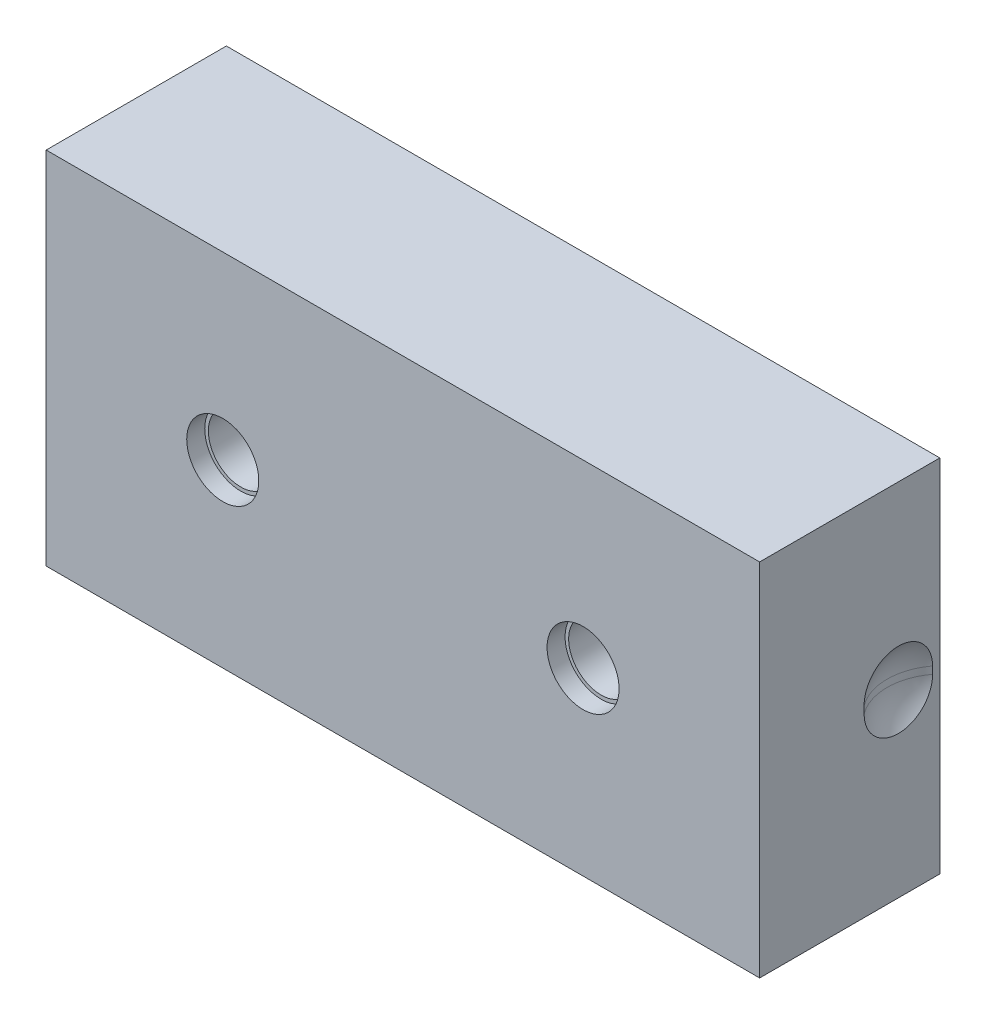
ISO-10303-21;
HEADER;
FILE_DESCRIPTION(('STEP AP214'),'2;1');
FILE_NAME('part.step','',(''),(''),'','','');
FILE_SCHEMA(('AUTOMOTIVE_DESIGN { 1 0 10303 214 1 1 1 1 }'));
ENDSEC;
DATA;
#1=APPLICATION_CONTEXT('core data for automotive mechanical design processes');
#2=APPLICATION_PROTOCOL_DEFINITION('international standard','automotive_design',2000,#1);
#3=PRODUCT_CONTEXT('',#1,'mechanical');
#4=PRODUCT('Part','Part','',(#3));
#5=PRODUCT_RELATED_PRODUCT_CATEGORY('part','',(#4));
#6=PRODUCT_DEFINITION_FORMATION('','',#4);
#7=PRODUCT_DEFINITION_CONTEXT('part definition',#1,'design');
#8=PRODUCT_DEFINITION('design','',#6,#7);
#9=PRODUCT_DEFINITION_SHAPE('','',#8);
#10=(LENGTH_UNIT() NAMED_UNIT(*) SI_UNIT(.MILLI.,.METRE.));
#11=(NAMED_UNIT(*) PLANE_ANGLE_UNIT() SI_UNIT($,.RADIAN.));
#12=(NAMED_UNIT(*) SI_UNIT($,.STERADIAN.) SOLID_ANGLE_UNIT());
#13=UNCERTAINTY_MEASURE_WITH_UNIT(LENGTH_MEASURE(1.E-05),#10,'distance_accuracy_value','');
#14=(GEOMETRIC_REPRESENTATION_CONTEXT(3) GLOBAL_UNCERTAINTY_ASSIGNED_CONTEXT((#13)) GLOBAL_UNIT_ASSIGNED_CONTEXT((#10,
#11,#12)) REPRESENTATION_CONTEXT('',''));
#15=CARTESIAN_POINT('',(0.,0.,0.));
#16=DIRECTION('',(0.,0.,1.));
#17=DIRECTION('',(1.,0.,0.));
#18=AXIS2_PLACEMENT_3D('',#15,#16,#17);
#19=CARTESIAN_POINT('',(-74.5004119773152,-24.0004119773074,99.5));
#20=DIRECTION('',(0.,0.,1.));
#21=DIRECTION('',(1.,0.,0.));
#22=AXIS2_PLACEMENT_3D('',#19,#20,#21);
#23=CYLINDRICAL_SURFACE('',#22,9.);
#24=CARTESIAN_POINT('',(-74.5004119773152,-24.0004119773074,79.5));
#25=DIRECTION('',(0.,0.,1.));
#26=DIRECTION('',(1.,0.,0.));
#27=AXIS2_PLACEMENT_3D('',#24,#25,#26);
#28=CIRCLE('',#27,9.);
#29=CARTESIAN_POINT('',(-65.5004119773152,-24.0004119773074,79.5));
#30=VERTEX_POINT('',#29);
#31=EDGE_CURVE('E284',#30,#30,#28,.F.);
#32=ORIENTED_EDGE('',*,*,#31,.T.);
#33=EDGE_LOOP('',(#32));
#34=FACE_BOUND('',#33,.T.);
#35=CARTESIAN_POINT('',(-74.5004119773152,-24.0004119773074,114.5));
#36=DIRECTION('',(0.,0.,1.));
#37=DIRECTION('',(1.,0.,0.));
#38=AXIS2_PLACEMENT_3D('',#35,#36,#37);
#39=CIRCLE('',#38,9.);
#40=CARTESIAN_POINT('',(-65.5004119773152,-24.0004119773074,114.5));
#41=VERTEX_POINT('',#40);
#42=EDGE_CURVE('E282',#41,#41,#39,.T.);
#43=ORIENTED_EDGE('',*,*,#42,.T.);
#44=EDGE_LOOP('',(#43));
#45=FACE_BOUND('',#44,.T.);
#46=ADVANCED_FACE('F14',(#34,#45),#23,.F.);
#47=CARTESIAN_POINT('',(-174.500411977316,-24.0004119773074,99.5));
#48=DIRECTION('',(0.,0.,1.));
#49=DIRECTION('',(1.,0.,0.));
#50=AXIS2_PLACEMENT_3D('',#47,#48,#49);
#51=CYLINDRICAL_SURFACE('',#50,9.);
#52=CARTESIAN_POINT('',(-174.500411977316,-24.0004119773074,79.5));
#53=DIRECTION('',(0.,0.,1.));
#54=DIRECTION('',(1.,0.,0.));
#55=AXIS2_PLACEMENT_3D('',#52,#53,#54);
#56=CIRCLE('',#55,9.);
#57=CARTESIAN_POINT('',(-165.500411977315,-24.0004119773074,79.5));
#58=VERTEX_POINT('',#57);
#59=EDGE_CURVE('E18',#58,#58,#56,.F.);
#60=ORIENTED_EDGE('',*,*,#59,.T.);
#61=EDGE_LOOP('',(#60));
#62=FACE_BOUND('',#61,.T.);
#63=CARTESIAN_POINT('',(-174.500411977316,-24.0004119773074,114.5));
#64=DIRECTION('',(0.,0.,1.));
#65=DIRECTION('',(1.,0.,0.));
#66=AXIS2_PLACEMENT_3D('',#63,#64,#65);
#67=CIRCLE('',#66,9.);
#68=CARTESIAN_POINT('',(-165.500411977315,-24.0004119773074,114.5));
#69=VERTEX_POINT('',#68);
#70=EDGE_CURVE('E279',#69,#69,#67,.T.);
#71=ORIENTED_EDGE('',*,*,#70,.T.);
#72=EDGE_LOOP('',(#71));
#73=FACE_BOUND('',#72,.T.);
#74=ADVANCED_FACE('F291',(#62,#73),#51,.F.);
#75=CARTESIAN_POINT('',(-174.500411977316,-24.0004119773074,79.5));
#76=DIRECTION('',(0.,0.,-1.));
#77=DIRECTION('',(-1.,0.,0.));
#78=AXIS2_PLACEMENT_3D('',#75,#76,#77);
#79=PLANE('',#78);
#80=ORIENTED_EDGE('',*,*,#59,.F.);
#81=EDGE_LOOP('',(#80));
#82=FACE_BOUND('',#81,.T.);
#83=CARTESIAN_POINT('',(-174.500411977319,-24.0004119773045,79.4999999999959));
#84=DIRECTION('',(0.,0.,1.));
#85=DIRECTION('',(1.,0.,0.));
#86=AXIS2_PLACEMENT_3D('',#83,#84,#85);
#87=CIRCLE('',#86,6.00000000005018);
#88=CARTESIAN_POINT('',(-168.500411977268,-24.0004119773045,79.4999999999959));
#89=VERTEX_POINT('',#88);
#90=EDGE_CURVE('E276',#89,#89,#87,.F.);
#91=ORIENTED_EDGE('',*,*,#90,.T.);
#92=EDGE_LOOP('',(#91));
#93=FACE_BOUND('',#92,.T.);
#94=ADVANCED_FACE('F294',(#82,#93),#79,.F.);
#95=CARTESIAN_POINT('',(-74.5004119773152,-24.0004119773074,79.5));
#96=DIRECTION('',(0.,0.,-1.));
#97=DIRECTION('',(-1.,0.,0.));
#98=AXIS2_PLACEMENT_3D('',#95,#96,#97);
#99=PLANE('',#98);
#100=ORIENTED_EDGE('',*,*,#31,.F.);
#101=EDGE_LOOP('',(#100));
#102=FACE_BOUND('',#101,.T.);
#103=CARTESIAN_POINT('',(-74.5004119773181,-24.0004119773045,79.5000000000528));
#104=DIRECTION('',(0.,0.,1.));
#105=DIRECTION('',(1.,0.,0.));
#106=AXIS2_PLACEMENT_3D('',#103,#104,#105);
#107=CIRCLE('',#106,6.0000000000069);
#108=CARTESIAN_POINT('',(-68.5004119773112,-24.0004119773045,79.5000000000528));
#109=VERTEX_POINT('',#108);
#110=EDGE_CURVE('E273',#109,#109,#107,.F.);
#111=ORIENTED_EDGE('',*,*,#110,.T.);
#112=EDGE_LOOP('',(#111));
#113=FACE_BOUND('',#112,.T.);
#114=ADVANCED_FACE('F297',(#102,#113),#99,.F.);
#115=CARTESIAN_POINT('',(-74.5004119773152,-24.0004119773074,114.5));
#116=DIRECTION('',(0.,0.,-1.));
#117=DIRECTION('',(-1.,0.,0.));
#118=AXIS2_PLACEMENT_3D('',#115,#116,#117);
#119=PLANE('',#118);
#120=CARTESIAN_POINT('',(-74.5004119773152,-24.0004119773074,114.5));
#121=DIRECTION('',(0.,0.,-1.));
#122=DIRECTION('',(-1.,0.,0.));
#123=AXIS2_PLACEMENT_3D('',#120,#121,#122);
#124=CIRCLE('',#123,10.);
#125=CARTESIAN_POINT('',(-84.5004119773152,-24.0004119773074,114.5));
#126=VERTEX_POINT('',#125);
#127=EDGE_CURVE('E270',#126,#126,#124,.F.);
#128=ORIENTED_EDGE('',*,*,#127,.T.);
#129=EDGE_LOOP('',(#128));
#130=FACE_BOUND('',#129,.T.);
#131=ORIENTED_EDGE('',*,*,#42,.F.);
#132=EDGE_LOOP('',(#131));
#133=FACE_BOUND('',#132,.T.);
#134=ADVANCED_FACE('F334',(#130,#133),#119,.F.);
#135=CARTESIAN_POINT('',(-174.500411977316,-24.0004119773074,114.5));
#136=DIRECTION('',(0.,0.,-1.));
#137=DIRECTION('',(-1.,0.,0.));
#138=AXIS2_PLACEMENT_3D('',#135,#136,#137);
#139=PLANE('',#138);
#140=CARTESIAN_POINT('',(-174.500411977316,-24.0004119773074,114.5));
#141=DIRECTION('',(0.,0.,-1.));
#142=DIRECTION('',(-1.,0.,0.));
#143=AXIS2_PLACEMENT_3D('',#140,#141,#142);
#144=CIRCLE('',#143,10.);
#145=CARTESIAN_POINT('',(-184.500411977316,-24.0004119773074,114.5));
#146=VERTEX_POINT('',#145);
#147=EDGE_CURVE('E220',#146,#146,#144,.F.);
#148=ORIENTED_EDGE('',*,*,#147,.T.);
#149=EDGE_LOOP('',(#148));
#150=FACE_BOUND('',#149,.T.);
#151=ORIENTED_EDGE('',*,*,#70,.F.);
#152=EDGE_LOOP('',(#151));
#153=FACE_BOUND('',#152,.T.);
#154=ADVANCED_FACE('F305',(#150,#153),#139,.F.);
#155=CARTESIAN_POINT('',(-174.500411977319,-24.0004119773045,79.4999999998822));
#156=DIRECTION('',(0.,0.,1.));
#157=DIRECTION('',(1.,0.,0.));
#158=AXIS2_PLACEMENT_3D('',#155,#156,#157);
#159=CONICAL_SURFACE('',#158,5.99999999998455,0.523598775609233);
#160=ORIENTED_EDGE('',*,*,#90,.F.);
#161=EDGE_LOOP('',(#160));
#162=FACE_BOUND('',#161,.T.);
#163=CARTESIAN_POINT('',(-174.500411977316,-24.0004119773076,78.2009618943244));
#164=DIRECTION('',(1.81804897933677E-13,-1.75169682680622E-13,-1.));
#165=DIRECTION('',(-1.,0.,-1.81804897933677E-13));
#166=AXIS2_PLACEMENT_3D('',#163,#164,#165);
#167=CIRCLE('',#166,5.25);
#168=CARTESIAN_POINT('',(-179.750411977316,-24.0004119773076,78.2009618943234));
#169=VERTEX_POINT('',#168);
#170=EDGE_CURVE('E218',#169,#169,#167,.T.);
#171=ORIENTED_EDGE('',*,*,#170,.T.);
#172=EDGE_LOOP('',(#171));
#173=FACE_BOUND('',#172,.T.);
#174=ADVANCED_FACE('F301',(#162,#173),#159,.F.);
#175=CARTESIAN_POINT('',(-74.5004119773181,-24.0004119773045,79.5000000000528));
#176=DIRECTION('',(0.,0.,1.));
#177=DIRECTION('',(1.,0.,0.));
#178=AXIS2_PLACEMENT_3D('',#175,#176,#177);
#179=CONICAL_SURFACE('',#178,6.0000000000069,0.523598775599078);
#180=ORIENTED_EDGE('',*,*,#110,.F.);
#181=EDGE_LOOP('',(#180));
#182=FACE_BOUND('',#181,.T.);
#183=CARTESIAN_POINT('',(-74.5004119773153,-24.0004119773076,78.2009618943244));
#184=DIRECTION('',(1.81804897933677E-13,-1.75169682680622E-13,-1.));
#185=DIRECTION('',(-1.,0.,-1.81804897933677E-13));
#186=AXIS2_PLACEMENT_3D('',#183,#184,#185);
#187=CIRCLE('',#186,5.25);
#188=CARTESIAN_POINT('',(-79.7504119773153,-24.0004119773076,78.2009618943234));
#189=VERTEX_POINT('',#188);
#190=EDGE_CURVE('E80',#189,#189,#187,.T.);
#191=ORIENTED_EDGE('',*,*,#190,.T.);
#192=EDGE_LOOP('',(#191));
#193=FACE_BOUND('',#192,.T.);
#194=ADVANCED_FACE('F304',(#182,#193),#179,.F.);
#195=CARTESIAN_POINT('',(-74.5004119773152,-24.0004119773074,117.));
#196=DIRECTION('',(0.,0.,-1.));
#197=DIRECTION('',(-1.,0.,0.));
#198=AXIS2_PLACEMENT_3D('',#195,#196,#197);
#199=CYLINDRICAL_SURFACE('',#198,10.);
#200=CARTESIAN_POINT('',(-74.5004119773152,-24.0004119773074,119.5));
#201=DIRECTION('',(0.,0.,-1.));
#202=DIRECTION('',(-1.,0.,0.));
#203=AXIS2_PLACEMENT_3D('',#200,#201,#202);
#204=CIRCLE('',#203,10.);
#205=CARTESIAN_POINT('',(-84.5004119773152,-24.0004119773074,119.5));
#206=VERTEX_POINT('',#205);
#207=EDGE_CURVE('E515',#206,#206,#204,.F.);
#208=ORIENTED_EDGE('',*,*,#207,.T.);
#209=EDGE_LOOP('',(#208));
#210=FACE_BOUND('',#209,.T.);
#211=ORIENTED_EDGE('',*,*,#127,.F.);
#212=EDGE_LOOP('',(#211));
#213=FACE_BOUND('',#212,.T.);
#214=ADVANCED_FACE('F321',(#210,#213),#199,.F.);
#215=CARTESIAN_POINT('',(-174.500411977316,-24.0004119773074,117.));
#216=DIRECTION('',(0.,0.,-1.));
#217=DIRECTION('',(-1.,0.,0.));
#218=AXIS2_PLACEMENT_3D('',#215,#216,#217);
#219=CYLINDRICAL_SURFACE('',#218,10.);
#220=CARTESIAN_POINT('',(-174.500411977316,-24.0004119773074,119.5));
#221=DIRECTION('',(0.,0.,-1.));
#222=DIRECTION('',(-1.,0.,0.));
#223=AXIS2_PLACEMENT_3D('',#220,#221,#222);
#224=CIRCLE('',#223,10.);
#225=CARTESIAN_POINT('',(-184.500411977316,-24.0004119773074,119.5));
#226=VERTEX_POINT('',#225);
#227=EDGE_CURVE('E512',#226,#226,#224,.F.);
#228=ORIENTED_EDGE('',*,*,#227,.T.);
#229=EDGE_LOOP('',(#228));
#230=FACE_BOUND('',#229,.T.);
#231=ORIENTED_EDGE('',*,*,#147,.F.);
#232=EDGE_LOOP('',(#231));
#233=FACE_BOUND('',#232,.T.);
#234=ADVANCED_FACE('F312',(#230,#233),#219,.F.);
#235=CARTESIAN_POINT('',(-174.500411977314,-24.0004119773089,71.));
#236=DIRECTION('',(1.81804897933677E-13,-1.75169682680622E-13,-1.));
#237=DIRECTION('',(-1.,0.,-1.81804897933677E-13));
#238=AXIS2_PLACEMENT_3D('',#235,#236,#237);
#239=CYLINDRICAL_SURFACE('',#238,5.25);
#240=CARTESIAN_POINT('',(-174.500411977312,-24.0004119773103,62.4999999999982));
#241=DIRECTION('',(1.81804897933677E-13,-1.75169682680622E-13,-1.));
#242=DIRECTION('',(-1.,0.,-1.81804897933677E-13));
#243=AXIS2_PLACEMENT_3D('',#240,#241,#242);
#244=CIRCLE('',#243,5.25);
#245=CARTESIAN_POINT('',(-179.750411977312,-24.0004119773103,62.4999999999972));
#246=VERTEX_POINT('',#245);
#247=EDGE_CURVE('E517',#246,#246,#244,.F.);
#248=ORIENTED_EDGE('',*,*,#247,.F.);
#249=EDGE_LOOP('',(#248));
#250=FACE_BOUND('',#249,.T.);
#251=ORIENTED_EDGE('',*,*,#170,.F.);
#252=EDGE_LOOP('',(#251));
#253=FACE_BOUND('',#252,.T.);
#254=ADVANCED_FACE('F309',(#250,#253),#239,.F.);
#255=CARTESIAN_POINT('',(-74.500411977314,-24.0004119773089,71.));
#256=DIRECTION('',(1.81804897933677E-13,-1.75169682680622E-13,-1.));
#257=DIRECTION('',(-1.,0.,-1.81804897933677E-13));
#258=AXIS2_PLACEMENT_3D('',#255,#256,#257);
#259=CYLINDRICAL_SURFACE('',#258,5.25);
#260=CARTESIAN_POINT('',(-74.5004119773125,-24.0004119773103,62.4999999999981));
#261=DIRECTION('',(1.81804897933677E-13,-1.75169682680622E-13,-1.));
#262=DIRECTION('',(-1.,0.,-1.81804897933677E-13));
#263=AXIS2_PLACEMENT_3D('',#260,#261,#262);
#264=CIRCLE('',#263,5.25);
#265=CARTESIAN_POINT('',(-79.7504119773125,-24.0004119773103,62.4999999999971));
#266=VERTEX_POINT('',#265);
#267=EDGE_CURVE('E89',#266,#266,#264,.F.);
#268=ORIENTED_EDGE('',*,*,#267,.F.);
#269=EDGE_LOOP('',(#268));
#270=FACE_BOUND('',#269,.T.);
#271=ORIENTED_EDGE('',*,*,#190,.F.);
#272=EDGE_LOOP('',(#271));
#273=FACE_BOUND('',#272,.T.);
#274=ADVANCED_FACE('F311',(#270,#273),#259,.F.);
#275=CARTESIAN_POINT('',(-236.250411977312,-25.0005435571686,81.));
#276=DIRECTION('',(0.490058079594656,0.735052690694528,0.46855161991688));
#277=DIRECTION('',(-0.865395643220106,0.34577965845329,0.362666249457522));
#278=AXIS2_PLACEMENT_3D('',#275,#276,#277);
#279=SPHERICAL_SURFACE('',#278,15.9);
#280=CARTESIAN_POINT('',(-236.250411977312,-25.0005435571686,81.));
#281=DIRECTION('',(0.,-1.,0.));
#282=DIRECTION('',(0.,0.,-1.));
#283=AXIS2_PLACEMENT_3D('',#280,#281,#282);
#284=CIRCLE('',#283,15.9);
#285=CARTESIAN_POINT('',(-223.500411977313,-25.0005435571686,90.4998684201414));
#286=VERTEX_POINT('',#285);
#287=CARTESIAN_POINT('',(-223.500411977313,-25.0005435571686,71.5001315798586));
#288=VERTEX_POINT('',#287);
#289=EDGE_CURVE('E74',#286,#288,#284,.F.);
#290=ORIENTED_EDGE('',*,*,#289,.T.);
#291=CARTESIAN_POINT('',(-223.500411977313,-25.0005435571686,71.5001315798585));
#292=CARTESIAN_POINT('',(-223.500411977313,-25.26773035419,71.5001028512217));
#293=CARTESIAN_POINT('',(-223.500411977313,-25.5349130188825,71.5114024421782));
#294=CARTESIAN_POINT('',(-223.500411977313,-26.0673668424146,71.556450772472));
#295=CARTESIAN_POINT('',(-223.500411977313,-26.3326380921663,71.5901984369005));
#296=CARTESIAN_POINT('',(-223.500411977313,-26.8592066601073,71.6799039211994));
#297=CARTESIAN_POINT('',(-223.500411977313,-27.1205066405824,71.7358461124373));
#298=CARTESIAN_POINT('',(-223.500411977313,-27.6374645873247,71.8695336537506));
#299=CARTESIAN_POINT('',(-223.500411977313,-27.8931226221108,71.9472787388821));
#300=CARTESIAN_POINT('',(-223.500411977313,-28.3970996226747,72.1240632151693));
#301=CARTESIAN_POINT('',(-223.500411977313,-28.6454151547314,72.2231123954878));
#302=CARTESIAN_POINT('',(-223.500411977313,-29.1328237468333,72.4417813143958));
#303=CARTESIAN_POINT('',(-223.500411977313,-29.3719166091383,72.5614014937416));
#304=CARTESIAN_POINT('',(-223.500411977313,-29.8391260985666,72.8203339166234));
#305=CARTESIAN_POINT('',(-223.500411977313,-30.067244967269,72.9596421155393));
#306=CARTESIAN_POINT('',(-223.500411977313,-30.5109364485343,73.2569781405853));
#307=CARTESIAN_POINT('',(-223.500411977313,-30.7265091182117,73.415005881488));
#308=CARTESIAN_POINT('',(-223.500411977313,-31.143584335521,73.7486640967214));
#309=CARTESIAN_POINT('',(-223.500411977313,-31.345086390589,73.9242951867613));
#310=CARTESIAN_POINT('',(-223.500411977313,-31.7325755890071,74.2919030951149));
#311=CARTESIAN_POINT('',(-223.500411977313,-31.9185630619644,74.4838795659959));
#312=CARTESIAN_POINT('',(-223.500411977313,-32.2737349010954,74.8828494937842));
#313=CARTESIAN_POINT('',(-223.500411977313,-32.4429165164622,75.0898453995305));
#314=CARTESIAN_POINT('',(-223.500411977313,-32.7632390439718,75.5173545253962));
#315=CARTESIAN_POINT('',(-223.500411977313,-32.9143799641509,75.7378677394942));
#316=CARTESIAN_POINT('',(-223.500411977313,-33.1975402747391,76.1908336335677));
#317=CARTESIAN_POINT('',(-223.500411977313,-33.3295605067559,76.4232857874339));
#318=CARTESIAN_POINT('',(-223.500411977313,-33.5735487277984,76.8984858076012));
#319=CARTESIAN_POINT('',(-223.500411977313,-33.6855167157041,77.1412336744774));
#320=CARTESIAN_POINT('',(-223.500411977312,-33.8885978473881,77.6352833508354));
#321=CARTESIAN_POINT('',(-223.500411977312,-33.979712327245,77.8865846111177));
#322=CARTESIAN_POINT('',(-223.500411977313,-34.1404478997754,78.395969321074));
#323=CARTESIAN_POINT('',(-223.500411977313,-34.2100689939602,78.6540527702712));
#324=CARTESIAN_POINT('',(-223.500411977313,-34.3273240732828,79.1751725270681));
#325=CARTESIAN_POINT('',(-223.500411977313,-34.3749576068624,79.4382089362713));
#326=CARTESIAN_POINT('',(-223.500411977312,-34.447896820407,79.9673594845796));
#327=CARTESIAN_POINT('',(-223.500411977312,-34.4732024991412,80.2334736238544));
#328=CARTESIAN_POINT('',(-223.500411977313,-34.5013064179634,80.7668938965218));
#329=CARTESIAN_POINT('',(-223.500411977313,-34.5041041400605,81.0342000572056));
#330=CARTESIAN_POINT('',(-223.500411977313,-34.4871708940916,81.568097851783));
#331=CARTESIAN_POINT('',(-223.500411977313,-34.4674399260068,81.8346894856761));
#332=CARTESIAN_POINT('',(-223.500411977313,-34.4055898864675,82.3652602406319));
#333=CARTESIAN_POINT('',(-223.500411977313,-34.3634710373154,82.629239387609));
#334=CARTESIAN_POINT('',(-223.500411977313,-34.2571448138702,83.1527111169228));
#335=CARTESIAN_POINT('',(-223.500411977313,-34.1929374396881,83.4122036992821));
#336=CARTESIAN_POINT('',(-223.500411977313,-34.0428908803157,83.9248566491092));
#337=CARTESIAN_POINT('',(-223.500411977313,-33.957051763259,84.1780170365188));
#338=CARTESIAN_POINT('',(-223.500411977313,-33.7643518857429,84.676206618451));
#339=CARTESIAN_POINT('',(-223.500411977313,-33.6574911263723,84.9212358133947));
#340=CARTESIAN_POINT('',(-223.500411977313,-33.4235058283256,85.4014248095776));
#341=CARTESIAN_POINT('',(-223.500411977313,-33.2963809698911,85.6365844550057));
#342=CARTESIAN_POINT('',(-223.500411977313,-33.0227696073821,86.0953631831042));
#343=CARTESIAN_POINT('',(-223.500411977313,-32.8762826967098,86.3189820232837));
#344=CARTESIAN_POINT('',(-223.500411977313,-32.5649999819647,86.753071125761));
#345=CARTESIAN_POINT('',(-223.500411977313,-32.4002052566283,86.9635421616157));
#346=CARTESIAN_POINT('',(-223.500411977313,-32.053471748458,87.3698533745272));
#347=CARTESIAN_POINT('',(-223.500411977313,-31.871532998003,87.565693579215));
#348=CARTESIAN_POINT('',(-223.500411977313,-31.4918300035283,87.9413261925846));
#349=CARTESIAN_POINT('',(-223.500411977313,-31.2940678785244,88.1211207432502));
#350=CARTESIAN_POINT('',(-223.500411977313,-30.8841024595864,88.46341367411));
#351=CARTESIAN_POINT('',(-223.500411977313,-30.6718991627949,88.625912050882));
#352=CARTESIAN_POINT('',(-223.500411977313,-30.2344865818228,88.932508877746));
#353=CARTESIAN_POINT('',(-223.500411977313,-30.0092729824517,89.0766011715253));
#354=CARTESIAN_POINT('',(-223.500411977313,-29.5475128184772,89.3452934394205));
#355=CARTESIAN_POINT('',(-223.500411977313,-29.3109665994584,89.4698940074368));
#356=CARTESIAN_POINT('',(-223.500411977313,-28.828063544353,89.6987950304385));
#357=CARTESIAN_POINT('',(-223.500411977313,-28.5817005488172,89.8030824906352));
#358=CARTESIAN_POINT('',(-223.500411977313,-28.0810642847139,89.9905132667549));
#359=CARTESIAN_POINT('',(-223.500411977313,-27.8267912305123,90.0736571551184));
#360=CARTESIAN_POINT('',(-223.500411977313,-27.3124764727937,90.2181196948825));
#361=CARTESIAN_POINT('',(-223.500411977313,-27.0524425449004,90.2794660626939));
#362=CARTESIAN_POINT('',(-223.500411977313,-26.5282358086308,90.3800228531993));
#363=CARTESIAN_POINT('',(-223.500411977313,-26.264065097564,90.4192441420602));
#364=CARTESIAN_POINT('',(-223.500411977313,-25.8328568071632,90.4648086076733));
#365=CARTESIAN_POINT('',(-223.500411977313,-25.666509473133,90.4779644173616));
#366=CARTESIAN_POINT('',(-223.500411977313,-25.3336283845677,90.4954880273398));
#367=CARTESIAN_POINT('',(-223.500411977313,-25.1670953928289,90.4998703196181));
#368=CARTESIAN_POINT('',(-223.500411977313,-25.0005435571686,90.4998684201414));
#369=B_SPLINE_CURVE_WITH_KNOTS('',3,(#291,#292,#293,#294,#295,#296,#297,#298,#299,#300,#301,
#302,#303,#304,#305,#306,#307,#308,#309,#310,#311,#312,#313,#314,#315,#316,#317,#318,#319,#320,
#321,#322,#323,#324,#325,#326,#327,#328,#329,#330,#331,#332,#333,#334,#335,#336,#337,#338,#339,
#340,#341,#342,#343,#344,#345,#346,#347,#348,#349,#350,#351,#352,#353,#354,#355,#356,#357,#358,
#359,#360,#361,#362,#363,#364,#365,#366,#367,#368),.UNSPECIFIED.,.F.,.F.,(4,2,2,2,2,2,2,2,2,2,2,
2,2,2,2,2,2,2,2,2,2,2,2,2,2,2,2,2,2,2,2,2,2,2,2,2,2,2,4),(0.,0.801315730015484,1.60259309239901,
2.40330722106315,3.20401162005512,4.00508472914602,4.80617500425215,5.60710094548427,
6.40802324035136,7.20897355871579,8.00990685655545,8.81097103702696,9.6120348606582,
10.4130634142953,11.214092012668,12.0150692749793,12.8160464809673,13.6170401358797,
14.4180338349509,15.219045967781,16.0200581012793,16.8210622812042,17.6220664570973,
18.4230681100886,19.2240697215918,20.0250839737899,20.8261150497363,21.6270989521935,
22.4280813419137,23.2289566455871,24.0298321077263,24.8309747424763,25.6320929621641,
26.4337220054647,27.2353293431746,28.0359137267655,28.8361045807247,29.3364921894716,
29.8360525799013),.UNSPECIFIED.);
#370=EDGE_CURVE('E72',#288,#286,#369,.T.);
#371=ORIENTED_EDGE('',*,*,#370,.T.);
#372=EDGE_LOOP('',(#290,#371));
#373=FACE_BOUND('',#372,.T.);
#374=ADVANCED_FACE('F76',(#373),#279,.F.);
#375=CARTESIAN_POINT('',(-236.250411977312,8.66438002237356,81.));
#376=DIRECTION('',(0.,-1.,0.));
#377=DIRECTION('',(0.,0.,-1.));
#378=AXIS2_PLACEMENT_3D('',#375,#376,#377);
#379=CYLINDRICAL_SURFACE('',#378,15.9);
#380=ORIENTED_EDGE('',*,*,#289,.F.);
#381=DIRECTION('',(0.,1.,0.));
#382=VECTOR('',#381,1.);
#383=CARTESIAN_POINT('',(-223.500411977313,-24.0004119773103,90.4998684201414));
#384=LINE('',#383,#382);
#385=CARTESIAN_POINT('',(-223.500411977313,-23.0002803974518,90.4998684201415));
#386=VERTEX_POINT('',#385);
#387=EDGE_CURVE('E92',#286,#386,#384,.T.);
#388=ORIENTED_EDGE('',*,*,#387,.T.);
#389=CARTESIAN_POINT('',(-236.250411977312,-23.0002803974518,81.));
#390=DIRECTION('',(0.,-1.,0.));
#391=DIRECTION('',(0.,0.,-1.));
#392=AXIS2_PLACEMENT_3D('',#389,#390,#391);
#393=CIRCLE('',#392,15.9);
#394=CARTESIAN_POINT('',(-223.500411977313,-23.0002803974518,71.5001315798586));
#395=VERTEX_POINT('',#394);
#396=EDGE_CURVE('E79',#386,#395,#393,.F.);
#397=ORIENTED_EDGE('',*,*,#396,.T.);
#398=DIRECTION('',(0.,1.,0.));
#399=VECTOR('',#398,1.);
#400=CARTESIAN_POINT('',(-223.500411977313,-24.0004119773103,71.5001315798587));
#401=LINE('',#400,#399);
#402=EDGE_CURVE('E83',#395,#288,#401,.F.);
#403=ORIENTED_EDGE('',*,*,#402,.T.);
#404=EDGE_LOOP('',(#380,#388,#397,#403));
#405=FACE_BOUND('',#404,.T.);
#406=ADVANCED_FACE('F84',(#405),#379,.F.);
#407=CARTESIAN_POINT('',(-236.250411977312,-23.0002803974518,81.));
#408=DIRECTION('',(0.490058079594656,0.735052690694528,0.46855161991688));
#409=DIRECTION('',(-0.865395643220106,0.34577965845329,0.362666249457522));
#410=AXIS2_PLACEMENT_3D('',#407,#408,#409);
#411=SPHERICAL_SURFACE('',#410,15.9);
#412=ORIENTED_EDGE('',*,*,#396,.F.);
#413=CARTESIAN_POINT('',(-223.500411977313,-23.0002803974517,90.4998684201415));
#414=CARTESIAN_POINT('',(-223.500411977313,-22.7330936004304,90.4998971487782));
#415=CARTESIAN_POINT('',(-223.500411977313,-22.465910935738,90.4885975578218));
#416=CARTESIAN_POINT('',(-223.500411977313,-21.9334571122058,90.4435492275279));
#417=CARTESIAN_POINT('',(-223.500411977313,-21.6681858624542,90.4098015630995));
#418=CARTESIAN_POINT('',(-223.500411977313,-21.1416172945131,90.3200960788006));
#419=CARTESIAN_POINT('',(-223.500411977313,-20.880317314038,90.2641538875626));
#420=CARTESIAN_POINT('',(-223.500411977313,-20.3633593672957,90.1304663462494));
#421=CARTESIAN_POINT('',(-223.500411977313,-20.1077013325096,90.052721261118));
#422=CARTESIAN_POINT('',(-223.500411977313,-19.6037243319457,89.8759367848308));
#423=CARTESIAN_POINT('',(-223.500411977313,-19.3554087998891,89.7768876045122));
#424=CARTESIAN_POINT('',(-223.500411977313,-18.8680002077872,89.5582186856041));
#425=CARTESIAN_POINT('',(-223.500411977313,-18.6289073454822,89.4385985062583));
#426=CARTESIAN_POINT('',(-223.500411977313,-18.1616978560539,89.1796660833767));
#427=CARTESIAN_POINT('',(-223.500411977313,-17.9335789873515,89.0403578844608));
#428=CARTESIAN_POINT('',(-223.500411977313,-17.4898875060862,88.7430218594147));
#429=CARTESIAN_POINT('',(-223.500411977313,-17.2743148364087,88.5849941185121));
#430=CARTESIAN_POINT('',(-223.500411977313,-16.8572396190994,88.2513359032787));
#431=CARTESIAN_POINT('',(-223.500411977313,-16.6557375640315,88.0757048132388));
#432=CARTESIAN_POINT('',(-223.500411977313,-16.2682483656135,87.7080969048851));
#433=CARTESIAN_POINT('',(-223.500411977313,-16.0822608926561,87.5161204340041));
#434=CARTESIAN_POINT('',(-223.500411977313,-15.7270890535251,87.1171505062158));
#435=CARTESIAN_POINT('',(-223.500411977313,-15.5579074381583,86.9101546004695));
#436=CARTESIAN_POINT('',(-223.500411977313,-15.2375849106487,86.4826454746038));
#437=CARTESIAN_POINT('',(-223.500411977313,-15.0864439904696,86.2621322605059));
#438=CARTESIAN_POINT('',(-223.500411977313,-14.8032836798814,85.8091663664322));
#439=CARTESIAN_POINT('',(-223.500411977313,-14.6712634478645,85.5767142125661));
#440=CARTESIAN_POINT('',(-223.500411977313,-14.427275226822,85.1015141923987));
#441=CARTESIAN_POINT('',(-223.500411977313,-14.3153072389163,84.8587663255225));
#442=CARTESIAN_POINT('',(-223.500411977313,-14.1122261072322,84.3647166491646));
#443=CARTESIAN_POINT('',(-223.500411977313,-14.0211116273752,84.1134153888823));
#444=CARTESIAN_POINT('',(-223.500411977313,-13.8603760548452,83.6040306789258));
#445=CARTESIAN_POINT('',(-223.500411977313,-13.7907549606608,83.3459472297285));
#446=CARTESIAN_POINT('',(-223.500411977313,-13.6734998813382,82.8248274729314));
#447=CARTESIAN_POINT('',(-223.500411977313,-13.6258663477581,82.5617910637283));
#448=CARTESIAN_POINT('',(-223.500411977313,-13.5529271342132,82.0326405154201));
#449=CARTESIAN_POINT('',(-223.500411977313,-13.5276214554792,81.7665263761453));
#450=CARTESIAN_POINT('',(-223.500411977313,-13.4995175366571,81.2331061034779));
#451=CARTESIAN_POINT('',(-223.500411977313,-13.4967198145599,80.9657999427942));
#452=CARTESIAN_POINT('',(-223.500411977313,-13.513653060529,80.4319021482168));
#453=CARTESIAN_POINT('',(-223.500411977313,-13.5333840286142,80.1653105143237));
#454=CARTESIAN_POINT('',(-223.500411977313,-13.5952340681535,79.6347397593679));
#455=CARTESIAN_POINT('',(-223.500411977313,-13.6373529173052,79.3707606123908));
#456=CARTESIAN_POINT('',(-223.500411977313,-13.7436791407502,78.8472888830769));
#457=CARTESIAN_POINT('',(-223.500411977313,-13.8078865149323,78.5877963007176));
#458=CARTESIAN_POINT('',(-223.500411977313,-13.9579330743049,78.0751433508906));
#459=CARTESIAN_POINT('',(-223.500411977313,-14.0437721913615,77.8219829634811));
#460=CARTESIAN_POINT('',(-223.500411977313,-14.2364720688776,77.323793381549));
#461=CARTESIAN_POINT('',(-223.500411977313,-14.3433328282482,77.0787641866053));
#462=CARTESIAN_POINT('',(-223.500411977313,-14.5773181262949,76.5985751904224));
#463=CARTESIAN_POINT('',(-223.500411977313,-14.7044429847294,76.3634155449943));
#464=CARTESIAN_POINT('',(-223.500411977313,-14.9780543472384,75.9046368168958));
#465=CARTESIAN_POINT('',(-223.500411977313,-15.1245412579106,75.6810179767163));
#466=CARTESIAN_POINT('',(-223.500411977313,-15.4358239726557,75.2469288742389));
#467=CARTESIAN_POINT('',(-223.500411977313,-15.6006186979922,75.0364578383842));
#468=CARTESIAN_POINT('',(-223.500411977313,-15.9473522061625,74.6301466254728));
#469=CARTESIAN_POINT('',(-223.500411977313,-16.1292909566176,74.434306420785));
#470=CARTESIAN_POINT('',(-223.500411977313,-16.5089939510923,74.0586738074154));
#471=CARTESIAN_POINT('',(-223.500411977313,-16.7067560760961,73.8788792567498));
#472=CARTESIAN_POINT('',(-223.500411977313,-17.1167214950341,73.5365863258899));
#473=CARTESIAN_POINT('',(-223.500411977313,-17.3289247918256,73.3740879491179));
#474=CARTESIAN_POINT('',(-223.500411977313,-17.7663373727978,73.0674911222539));
#475=CARTESIAN_POINT('',(-223.500411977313,-17.9915509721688,72.9233988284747));
#476=CARTESIAN_POINT('',(-223.500411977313,-18.4533111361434,72.6547065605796));
#477=CARTESIAN_POINT('',(-223.500411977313,-18.6898573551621,72.5301059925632));
#478=CARTESIAN_POINT('',(-223.500411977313,-19.1727604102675,72.3012049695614));
#479=CARTESIAN_POINT('',(-223.500411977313,-19.4191234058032,72.1969175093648));
#480=CARTESIAN_POINT('',(-223.500411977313,-19.9197596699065,72.009486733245));
#481=CARTESIAN_POINT('',(-223.500411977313,-20.1740327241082,71.9263428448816));
#482=CARTESIAN_POINT('',(-223.500411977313,-20.6883474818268,71.7818803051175));
#483=CARTESIAN_POINT('',(-223.500411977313,-20.9483814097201,71.7205339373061));
#484=CARTESIAN_POINT('',(-223.500411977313,-21.4725881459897,71.6199771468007));
#485=CARTESIAN_POINT('',(-223.500411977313,-21.7367588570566,71.5807558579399));
#486=CARTESIAN_POINT('',(-223.500411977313,-22.1679671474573,71.5351913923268));
#487=CARTESIAN_POINT('',(-223.500411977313,-22.3343144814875,71.5220355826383));
#488=CARTESIAN_POINT('',(-223.500411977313,-22.6671955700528,71.5045119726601));
#489=CARTESIAN_POINT('',(-223.500411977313,-22.8337285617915,71.5001296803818));
#490=CARTESIAN_POINT('',(-223.500411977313,-23.0002803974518,71.5001315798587));
#491=B_SPLINE_CURVE_WITH_KNOTS('',3,(#413,#414,#415,#416,#417,#418,#419,#420,#421,#422,#423,
#424,#425,#426,#427,#428,#429,#430,#431,#432,#433,#434,#435,#436,#437,#438,#439,#440,#441,#442,
#443,#444,#445,#446,#447,#448,#449,#450,#451,#452,#453,#454,#455,#456,#457,#458,#459,#460,#461,
#462,#463,#464,#465,#466,#467,#468,#469,#470,#471,#472,#473,#474,#475,#476,#477,#478,#479,#480,
#481,#482,#483,#484,#485,#486,#487,#488,#489,#490),.UNSPECIFIED.,.F.,.F.,(4,2,2,2,2,2,2,2,2,2,2,
2,2,2,2,2,2,2,2,2,2,2,2,2,2,2,2,2,2,2,2,2,2,2,2,2,2,2,4),(0.,0.801315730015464,1.602593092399,
2.40330722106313,3.20401162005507,4.00508472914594,4.80617500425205,5.60710094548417,
6.40802324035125,7.20897355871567,8.00990685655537,8.81097103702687,9.61203486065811,
10.4130634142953,11.214092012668,12.0150692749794,12.8160464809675,13.61704013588,
14.418033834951,15.2190459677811,16.0200581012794,16.8210622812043,17.6220664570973,
18.4230681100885,19.2240697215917,20.0250839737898,20.8261150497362,21.6270989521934,
22.4280813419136,23.2289566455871,24.0298321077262,24.8309747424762,25.632092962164,
26.4337220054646,27.2353293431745,28.0359137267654,28.8361045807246,29.3364921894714,
29.8360525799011),.UNSPECIFIED.);
#492=EDGE_CURVE('E94',#386,#395,#491,.T.);
#493=ORIENTED_EDGE('',*,*,#492,.T.);
#494=EDGE_LOOP('',(#412,#493));
#495=FACE_BOUND('',#494,.T.);
#496=ADVANCED_FACE('F156',(#495),#411,.F.);
#497=CARTESIAN_POINT('',(-12.7504119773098,-25.0005435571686,81.));
#498=DIRECTION('',(0.490058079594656,0.735052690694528,0.46855161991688));
#499=DIRECTION('',(-0.865395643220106,0.34577965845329,0.362666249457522));
#500=AXIS2_PLACEMENT_3D('',#497,#498,#499);
#501=SPHERICAL_SURFACE('',#500,15.9);
#502=CARTESIAN_POINT('',(-12.7504119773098,-25.0005435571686,81.));
#503=DIRECTION('',(0.,1.,0.));
#504=DIRECTION('',(0.,0.,1.));
#505=AXIS2_PLACEMENT_3D('',#502,#503,#504);
#506=CIRCLE('',#505,15.9);
#507=CARTESIAN_POINT('',(-25.5004119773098,-25.0005435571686,71.5001315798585));
#508=VERTEX_POINT('',#507);
#509=CARTESIAN_POINT('',(-25.5004119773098,-25.0005435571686,90.4998684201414));
#510=VERTEX_POINT('',#509);
#511=EDGE_CURVE('E263',#508,#510,#506,.T.);
#512=ORIENTED_EDGE('',*,*,#511,.T.);
#513=CARTESIAN_POINT('',(-25.5004119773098,-25.0005435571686,90.4998684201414));
#514=CARTESIAN_POINT('',(-25.5004119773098,-25.26773035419,90.4998971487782));
#515=CARTESIAN_POINT('',(-25.5004119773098,-25.5349130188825,90.4885975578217));
#516=CARTESIAN_POINT('',(-25.5004119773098,-26.0673668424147,90.4435492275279));
#517=CARTESIAN_POINT('',(-25.5004119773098,-26.3326380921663,90.4098015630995));
#518=CARTESIAN_POINT('',(-25.5004119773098,-26.8592066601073,90.3200960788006));
#519=CARTESIAN_POINT('',(-25.5004119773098,-27.1205066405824,90.2641538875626));
#520=CARTESIAN_POINT('',(-25.5004119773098,-27.6374645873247,90.1304663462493));
#521=CARTESIAN_POINT('',(-25.5004119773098,-27.8931226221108,90.0527212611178));
#522=CARTESIAN_POINT('',(-25.5004119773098,-28.3970996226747,89.8759367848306));
#523=CARTESIAN_POINT('',(-25.5004119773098,-28.6454151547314,89.7768876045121));
#524=CARTESIAN_POINT('',(-25.5004119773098,-29.1328237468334,89.5582186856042));
#525=CARTESIAN_POINT('',(-25.5004119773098,-29.3719166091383,89.4385985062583));
#526=CARTESIAN_POINT('',(-25.5004119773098,-29.8391260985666,89.1796660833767));
#527=CARTESIAN_POINT('',(-25.5004119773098,-30.067244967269,89.0403578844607));
#528=CARTESIAN_POINT('',(-25.5004119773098,-30.5109364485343,88.7430218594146));
#529=CARTESIAN_POINT('',(-25.5004119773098,-30.7265091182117,88.5849941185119));
#530=CARTESIAN_POINT('',(-25.5004119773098,-31.143584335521,88.2513359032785));
#531=CARTESIAN_POINT('',(-25.5004119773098,-31.345086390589,88.0757048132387));
#532=CARTESIAN_POINT('',(-25.5004119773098,-31.7325755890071,87.708096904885));
#533=CARTESIAN_POINT('',(-25.5004119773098,-31.9185630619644,87.516120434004));
#534=CARTESIAN_POINT('',(-25.5004119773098,-32.2737349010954,87.1171505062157));
#535=CARTESIAN_POINT('',(-25.5004119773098,-32.4429165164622,86.9101546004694));
#536=CARTESIAN_POINT('',(-25.5004119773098,-32.7632390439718,86.4826454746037));
#537=CARTESIAN_POINT('',(-25.5004119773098,-32.9143799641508,86.2621322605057));
#538=CARTESIAN_POINT('',(-25.5004119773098,-33.197540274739,85.809166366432));
#539=CARTESIAN_POINT('',(-25.5004119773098,-33.3295605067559,85.5767142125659));
#540=CARTESIAN_POINT('',(-25.5004119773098,-33.5735487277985,85.1015141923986));
#541=CARTESIAN_POINT('',(-25.5004119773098,-33.6855167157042,84.8587663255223));
#542=CARTESIAN_POINT('',(-25.5004119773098,-33.8885978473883,84.3647166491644));
#543=CARTESIAN_POINT('',(-25.5004119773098,-33.9797123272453,84.1134153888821));
#544=CARTESIAN_POINT('',(-25.5004119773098,-34.1404478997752,83.6040306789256));
#545=CARTESIAN_POINT('',(-25.5004119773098,-34.2100689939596,83.3459472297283));
#546=CARTESIAN_POINT('',(-25.5004119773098,-34.3273240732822,82.8248274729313));
#547=CARTESIAN_POINT('',(-25.5004119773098,-34.3749576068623,82.5617910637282));
#548=CARTESIAN_POINT('',(-25.5004119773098,-34.4478968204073,82.0326405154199));
#549=CARTESIAN_POINT('',(-25.5004119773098,-34.4732024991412,81.7665263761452));
#550=CARTESIAN_POINT('',(-25.5004119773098,-34.5013064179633,81.2331061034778));
#551=CARTESIAN_POINT('',(-25.5004119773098,-34.5041041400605,80.965799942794));
#552=CARTESIAN_POINT('',(-25.5004119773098,-34.4871708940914,80.4319021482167));
#553=CARTESIAN_POINT('',(-25.5004119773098,-34.4674399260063,80.1653105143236));
#554=CARTESIAN_POINT('',(-25.5004119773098,-34.4055898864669,79.6347397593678));
#555=CARTESIAN_POINT('',(-25.5004119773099,-34.3634710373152,79.3707606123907));
#556=CARTESIAN_POINT('',(-25.5004119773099,-34.2571448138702,78.8472888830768));
#557=CARTESIAN_POINT('',(-25.5004119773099,-34.1929374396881,78.5877963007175));
#558=CARTESIAN_POINT('',(-25.5004119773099,-34.0428908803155,78.0751433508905));
#559=CARTESIAN_POINT('',(-25.5004119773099,-33.9570517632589,77.8219829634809));
#560=CARTESIAN_POINT('',(-25.5004119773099,-33.7643518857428,77.3237933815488));
#561=CARTESIAN_POINT('',(-25.5004119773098,-33.6574911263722,77.0787641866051));
#562=CARTESIAN_POINT('',(-25.5004119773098,-33.4235058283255,76.5985751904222));
#563=CARTESIAN_POINT('',(-25.5004119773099,-33.296380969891,76.3634155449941));
#564=CARTESIAN_POINT('',(-25.5004119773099,-33.022769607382,75.9046368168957));
#565=CARTESIAN_POINT('',(-25.5004119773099,-32.8762826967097,75.6810179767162));
#566=CARTESIAN_POINT('',(-25.5004119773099,-32.5649999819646,75.2469288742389));
#567=CARTESIAN_POINT('',(-25.5004119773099,-32.4002052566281,75.0364578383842));
#568=CARTESIAN_POINT('',(-25.5004119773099,-32.0534717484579,74.6301466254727));
#569=CARTESIAN_POINT('',(-25.5004119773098,-31.8715329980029,74.4343064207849));
#570=CARTESIAN_POINT('',(-25.5004119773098,-31.4918300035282,74.0586738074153));
#571=CARTESIAN_POINT('',(-25.5004119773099,-31.2940678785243,73.8788792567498));
#572=CARTESIAN_POINT('',(-25.5004119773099,-30.8841024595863,73.5365863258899));
#573=CARTESIAN_POINT('',(-25.5004119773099,-30.6718991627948,73.3740879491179));
#574=CARTESIAN_POINT('',(-25.5004119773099,-30.2344865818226,73.067491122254));
#575=CARTESIAN_POINT('',(-25.5004119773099,-30.0092729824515,72.9233988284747));
#576=CARTESIAN_POINT('',(-25.5004119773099,-29.5475128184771,72.6547065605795));
#577=CARTESIAN_POINT('',(-25.5004119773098,-29.3109665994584,72.5301059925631));
#578=CARTESIAN_POINT('',(-25.5004119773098,-28.828063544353,72.3012049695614));
#579=CARTESIAN_POINT('',(-25.5004119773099,-28.5817005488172,72.1969175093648));
#580=CARTESIAN_POINT('',(-25.5004119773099,-28.0810642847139,72.0094867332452));
#581=CARTESIAN_POINT('',(-25.5004119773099,-27.8267912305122,71.9263428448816));
#582=CARTESIAN_POINT('',(-25.5004119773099,-27.3124764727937,71.7818803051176));
#583=CARTESIAN_POINT('',(-25.5004119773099,-27.0524425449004,71.7205339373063));
#584=CARTESIAN_POINT('',(-25.5004119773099,-26.5282358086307,71.6199771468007));
#585=CARTESIAN_POINT('',(-25.5004119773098,-26.2640650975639,71.5807558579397));
#586=CARTESIAN_POINT('',(-25.5004119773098,-25.8328568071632,71.5351913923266));
#587=CARTESIAN_POINT('',(-25.5004119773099,-25.6665094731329,71.5220355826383));
#588=CARTESIAN_POINT('',(-25.5004119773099,-25.3336283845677,71.5045119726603));
#589=CARTESIAN_POINT('',(-25.5004119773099,-25.1670953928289,71.5001296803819));
#590=CARTESIAN_POINT('',(-25.5004119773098,-25.0005435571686,71.5001315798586));
#591=B_SPLINE_CURVE_WITH_KNOTS('',3,(#513,#514,#515,#516,#517,#518,#519,#520,#521,#522,#523,
#524,#525,#526,#527,#528,#529,#530,#531,#532,#533,#534,#535,#536,#537,#538,#539,#540,#541,#542,
#543,#544,#545,#546,#547,#548,#549,#550,#551,#552,#553,#554,#555,#556,#557,#558,#559,#560,#561,
#562,#563,#564,#565,#566,#567,#568,#569,#570,#571,#572,#573,#574,#575,#576,#577,#578,#579,#580,
#581,#582,#583,#584,#585,#586,#587,#588,#589,#590),.UNSPECIFIED.,.F.,.F.,(4,2,2,2,2,2,2,2,2,2,2,
2,2,2,2,2,2,2,2,2,2,2,2,2,2,2,2,2,2,2,2,2,2,2,2,2,2,2,4),(0.,0.801315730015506,1.60259309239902,
2.40330722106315,3.20401162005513,4.00508472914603,4.80617500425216,5.60710094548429,
6.40802324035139,7.20897355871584,8.00990685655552,8.81097103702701,9.61203486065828,
10.4130634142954,11.2140920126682,12.0150692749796,12.8160464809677,13.6170401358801,
14.4180338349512,15.2190459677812,16.0200581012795,16.8210622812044,17.6220664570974,
18.4230681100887,19.2240697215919,20.0250839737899,20.8261150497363,21.6270989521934,
22.4280813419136,23.2289566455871,24.0298321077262,24.8309747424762,25.6320929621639,
26.4337220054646,27.2353293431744,28.0359137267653,28.8361045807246,29.3364921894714,
29.8360525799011),.UNSPECIFIED.);
#592=EDGE_CURVE('E142',#510,#508,#591,.T.);
#593=ORIENTED_EDGE('',*,*,#592,.T.);
#594=EDGE_LOOP('',(#512,#593));
#595=FACE_BOUND('',#594,.T.);
#596=ADVANCED_FACE('F150',(#595),#501,.F.);
#597=CARTESIAN_POINT('',(-12.7504119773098,8.66438002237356,81.));
#598=DIRECTION('',(0.,1.,0.));
#599=DIRECTION('',(0.,0.,1.));
#600=AXIS2_PLACEMENT_3D('',#597,#598,#599);
#601=CYLINDRICAL_SURFACE('',#600,15.9);
#602=CARTESIAN_POINT('',(-12.7504119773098,-23.0002803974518,81.));
#603=DIRECTION('',(0.,1.,0.));
#604=DIRECTION('',(0.,0.,1.));
#605=AXIS2_PLACEMENT_3D('',#602,#603,#604);
#606=CIRCLE('',#605,15.9);
#607=CARTESIAN_POINT('',(-25.5004119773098,-23.0002803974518,71.5001315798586));
#608=VERTEX_POINT('',#607);
#609=CARTESIAN_POINT('',(-25.5004119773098,-23.0002803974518,90.4998684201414));
#610=VERTEX_POINT('',#609);
#611=EDGE_CURVE('E254',#608,#610,#606,.T.);
#612=ORIENTED_EDGE('',*,*,#611,.T.);
#613=DIRECTION('',(0.,1.,0.));
#614=VECTOR('',#613,1.);
#615=CARTESIAN_POINT('',(-25.5004119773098,-24.0004119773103,90.4998684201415));
#616=LINE('',#615,#614);
#617=EDGE_CURVE('E149',#610,#510,#616,.F.);
#618=ORIENTED_EDGE('',*,*,#617,.T.);
#619=ORIENTED_EDGE('',*,*,#511,.F.);
#620=DIRECTION('',(0.,1.,0.));
#621=VECTOR('',#620,1.);
#622=CARTESIAN_POINT('',(-25.5004119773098,-24.0004119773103,71.5001315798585));
#623=LINE('',#622,#621);
#624=EDGE_CURVE('E148',#508,#608,#623,.T.);
#625=ORIENTED_EDGE('',*,*,#624,.T.);
#626=EDGE_LOOP('',(#612,#618,#619,#625));
#627=FACE_BOUND('',#626,.T.);
#628=ADVANCED_FACE('F155',(#627),#601,.F.);
#629=CARTESIAN_POINT('',(-12.7504119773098,-23.0002803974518,81.));
#630=DIRECTION('',(0.490058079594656,0.735052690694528,0.46855161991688));
#631=DIRECTION('',(-0.865395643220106,0.34577965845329,0.362666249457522));
#632=AXIS2_PLACEMENT_3D('',#629,#630,#631);
#633=SPHERICAL_SURFACE('',#632,15.9);
#634=ORIENTED_EDGE('',*,*,#611,.F.);
#635=CARTESIAN_POINT('',(-25.5004119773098,-23.0002803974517,71.5001315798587));
#636=CARTESIAN_POINT('',(-25.5004119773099,-22.7330936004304,71.5001028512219));
#637=CARTESIAN_POINT('',(-25.5004119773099,-22.4659109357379,71.5114024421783));
#638=CARTESIAN_POINT('',(-25.5004119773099,-21.9334571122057,71.5564507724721));
#639=CARTESIAN_POINT('',(-25.5004119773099,-21.6681858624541,71.5901984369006));
#640=CARTESIAN_POINT('',(-25.5004119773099,-21.141617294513,71.6799039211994));
#641=CARTESIAN_POINT('',(-25.5004119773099,-20.880317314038,71.7358461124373));
#642=CARTESIAN_POINT('',(-25.5004119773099,-20.3633593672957,71.8695336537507));
#643=CARTESIAN_POINT('',(-25.5004119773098,-20.1077013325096,71.9472787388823));
#644=CARTESIAN_POINT('',(-25.5004119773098,-19.6037243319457,72.1240632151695));
#645=CARTESIAN_POINT('',(-25.5004119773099,-19.355408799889,72.223112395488));
#646=CARTESIAN_POINT('',(-25.5004119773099,-18.868000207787,72.4417813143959));
#647=CARTESIAN_POINT('',(-25.5004119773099,-18.6289073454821,72.5614014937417));
#648=CARTESIAN_POINT('',(-25.5004119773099,-18.1616978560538,72.8203339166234));
#649=CARTESIAN_POINT('',(-25.5004119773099,-17.9335789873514,72.9596421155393));
#650=CARTESIAN_POINT('',(-25.5004119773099,-17.4898875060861,73.2569781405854));
#651=CARTESIAN_POINT('',(-25.5004119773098,-17.2743148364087,73.4150058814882));
#652=CARTESIAN_POINT('',(-25.5004119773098,-16.8572396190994,73.7486640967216));
#653=CARTESIAN_POINT('',(-25.5004119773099,-16.6557375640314,73.9242951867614));
#654=CARTESIAN_POINT('',(-25.5004119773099,-16.2682483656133,74.291903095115));
#655=CARTESIAN_POINT('',(-25.5004119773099,-16.082260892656,74.4838795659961));
#656=CARTESIAN_POINT('',(-25.5004119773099,-15.727089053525,74.8828494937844));
#657=CARTESIAN_POINT('',(-25.5004119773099,-15.5579074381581,75.0898453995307));
#658=CARTESIAN_POINT('',(-25.5004119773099,-15.2375849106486,75.5173545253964));
#659=CARTESIAN_POINT('',(-25.5004119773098,-15.0864439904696,75.7378677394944));
#660=CARTESIAN_POINT('',(-25.5004119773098,-14.8032836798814,76.1908336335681));
#661=CARTESIAN_POINT('',(-25.5004119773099,-14.6712634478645,76.4232857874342));
#662=CARTESIAN_POINT('',(-25.5004119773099,-14.4272752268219,76.8984858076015));
#663=CARTESIAN_POINT('',(-25.5004119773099,-14.3153072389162,77.1412336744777));
#664=CARTESIAN_POINT('',(-25.5004119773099,-14.1122261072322,77.6352833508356));
#665=CARTESIAN_POINT('',(-25.5004119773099,-14.0211116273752,77.8865846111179));
#666=CARTESIAN_POINT('',(-25.5004119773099,-13.8603760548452,78.3959693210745));
#667=CARTESIAN_POINT('',(-25.5004119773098,-13.7907549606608,78.6540527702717));
#668=CARTESIAN_POINT('',(-25.5004119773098,-13.6734998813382,79.1751725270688));
#669=CARTESIAN_POINT('',(-25.5004119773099,-13.6258663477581,79.4382089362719));
#670=CARTESIAN_POINT('',(-25.5004119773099,-13.5529271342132,79.9673594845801));
#671=CARTESIAN_POINT('',(-25.5004119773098,-13.5276214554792,80.2334736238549));
#672=CARTESIAN_POINT('',(-25.5004119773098,-13.4995175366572,80.7668938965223));
#673=CARTESIAN_POINT('',(-25.5004119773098,-13.4967198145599,81.034200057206));
#674=CARTESIAN_POINT('',(-25.5004119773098,-13.513653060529,81.5680978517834));
#675=CARTESIAN_POINT('',(-25.5004119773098,-13.5333840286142,81.8346894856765));
#676=CARTESIAN_POINT('',(-25.5004119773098,-13.5952340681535,82.3652602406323));
#677=CARTESIAN_POINT('',(-25.5004119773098,-13.6373529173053,82.6292393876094));
#678=CARTESIAN_POINT('',(-25.5004119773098,-13.7436791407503,83.1527111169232));
#679=CARTESIAN_POINT('',(-25.5004119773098,-13.8078865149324,83.4122036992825));
#680=CARTESIAN_POINT('',(-25.5004119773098,-13.9579330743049,83.9248566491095));
#681=CARTESIAN_POINT('',(-25.5004119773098,-14.0437721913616,84.1780170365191));
#682=CARTESIAN_POINT('',(-25.5004119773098,-14.2364720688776,84.6762066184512));
#683=CARTESIAN_POINT('',(-25.5004119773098,-14.3433328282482,84.9212358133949));
#684=CARTESIAN_POINT('',(-25.5004119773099,-14.5773181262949,85.4014248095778));
#685=CARTESIAN_POINT('',(-25.5004119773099,-14.7044429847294,85.6365844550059));
#686=CARTESIAN_POINT('',(-25.5004119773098,-14.9780543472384,86.0953631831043));
#687=CARTESIAN_POINT('',(-25.5004119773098,-15.1245412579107,86.3189820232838));
#688=CARTESIAN_POINT('',(-25.5004119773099,-15.4358239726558,86.753071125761));
#689=CARTESIAN_POINT('',(-25.50041197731,-15.6006186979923,86.9635421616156));
#690=CARTESIAN_POINT('',(-25.5004119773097,-15.9473522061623,87.3698533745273));
#691=CARTESIAN_POINT('',(-25.5004119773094,-16.129290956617,87.5656935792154));
#692=CARTESIAN_POINT('',(-25.5004119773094,-16.5089939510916,87.941326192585));
#693=CARTESIAN_POINT('',(-25.5004119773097,-16.7067560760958,88.1211207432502));
#694=CARTESIAN_POINT('',(-25.50041197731,-17.116721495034,88.4634136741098));
#695=CARTESIAN_POINT('',(-25.5004119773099,-17.3289247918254,88.6259120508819));
#696=CARTESIAN_POINT('',(-25.5004119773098,-17.7663373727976,88.9325088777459));
#697=CARTESIAN_POINT('',(-25.5004119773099,-17.9915509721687,89.0766011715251));
#698=CARTESIAN_POINT('',(-25.5004119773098,-18.4533111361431,89.3452934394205));
#699=CARTESIAN_POINT('',(-25.5004119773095,-18.6898573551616,89.4698940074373));
#700=CARTESIAN_POINT('',(-25.5004119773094,-19.172760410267,89.6987950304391));
#701=CARTESIAN_POINT('',(-25.5004119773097,-19.4191234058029,89.8030824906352));
#702=CARTESIAN_POINT('',(-25.50041197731,-19.9197596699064,89.9905132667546));
#703=CARTESIAN_POINT('',(-25.5004119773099,-20.174032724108,90.0736571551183));
#704=CARTESIAN_POINT('',(-25.5004119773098,-20.6883474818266,90.2181196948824));
#705=CARTESIAN_POINT('',(-25.5004119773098,-20.94838140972,90.2794660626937));
#706=CARTESIAN_POINT('',(-25.5004119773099,-21.4725881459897,90.3800228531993));
#707=CARTESIAN_POINT('',(-25.5004119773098,-21.7367588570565,90.4192441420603));
#708=CARTESIAN_POINT('',(-25.5004119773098,-22.1679671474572,90.4648086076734));
#709=CARTESIAN_POINT('',(-25.5004119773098,-22.3343144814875,90.4779644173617));
#710=CARTESIAN_POINT('',(-25.5004119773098,-22.6671955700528,90.4954880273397));
#711=CARTESIAN_POINT('',(-25.5004119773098,-22.8337285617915,90.4998703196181));
#712=CARTESIAN_POINT('',(-25.5004119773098,-23.0002803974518,90.4998684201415));
#713=B_SPLINE_CURVE_WITH_KNOTS('',3,(#635,#636,#637,#638,#639,#640,#641,#642,#643,#644,#645,
#646,#647,#648,#649,#650,#651,#652,#653,#654,#655,#656,#657,#658,#659,#660,#661,#662,#663,#664,
#665,#666,#667,#668,#669,#670,#671,#672,#673,#674,#675,#676,#677,#678,#679,#680,#681,#682,#683,
#684,#685,#686,#687,#688,#689,#690,#691,#692,#693,#694,#695,#696,#697,#698,#699,#700,#701,#702,
#703,#704,#705,#706,#707,#708,#709,#710,#711,#712),.UNSPECIFIED.,.F.,.F.,(4,2,2,2,2,2,2,2,2,2,2,
2,2,2,2,2,2,2,2,2,2,2,2,2,2,2,2,2,2,2,2,2,2,2,2,2,2,2,4),(0.,0.801315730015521,1.60259309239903,
2.40330722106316,3.20401162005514,4.00508472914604,4.80617500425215,5.60710094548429,
6.40802324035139,7.20897355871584,8.00990685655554,8.81097103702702,9.61203486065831,
10.4130634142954,11.2140920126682,12.0150692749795,12.8160464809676,13.6170401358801,
14.4180338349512,15.2190459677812,16.0200581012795,16.8210622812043,17.6220664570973,
18.4230681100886,19.2240697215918,20.0250839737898,20.8261150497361,21.6270989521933,
22.4280813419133,23.2289566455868,24.029832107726,24.830974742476,25.6320929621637,
26.4337220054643,27.2353293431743,28.0359137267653,28.8361045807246,29.3364921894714,
29.8360525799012),.UNSPECIFIED.);
#714=EDGE_CURVE('E135',#608,#610,#713,.T.);
#715=ORIENTED_EDGE('',*,*,#714,.T.);
#716=EDGE_LOOP('',(#634,#715));
#717=FACE_BOUND('',#716,.T.);
#718=ADVANCED_FACE('F166',(#717),#633,.F.);
#719=CARTESIAN_POINT('',(-124.500411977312,-24.0004119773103,119.5));
#720=DIRECTION('',(0.,0.,-1.));
#721=DIRECTION('',(-1.,0.,0.));
#722=AXIS2_PLACEMENT_3D('',#719,#720,#721);
#723=PLANE('',#722);
#724=DIRECTION('',(1.,0.,0.));
#725=VECTOR('',#724,1.);
#726=CARTESIAN_POINT('',(-124.500411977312,-74.0004119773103,119.5));
#727=LINE('',#726,#725);
#728=CARTESIAN_POINT('',(-223.500411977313,-74.0004119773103,119.5));
#729=VERTEX_POINT('',#728);
#730=CARTESIAN_POINT('',(-25.5004119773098,-74.0004119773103,119.5));
#731=VERTEX_POINT('',#730);
#732=EDGE_CURVE('E227',#729,#731,#727,.T.);
#733=ORIENTED_EDGE('',*,*,#732,.T.);
#734=DIRECTION('',(0.,1.,0.));
#735=VECTOR('',#734,1.);
#736=CARTESIAN_POINT('',(-25.5004119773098,-24.0004119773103,119.5));
#737=LINE('',#736,#735);
#738=CARTESIAN_POINT('',(-25.5004119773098,25.9995880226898,119.5));
#739=VERTEX_POINT('',#738);
#740=EDGE_CURVE('E239',#731,#739,#737,.T.);
#741=ORIENTED_EDGE('',*,*,#740,.T.);
#742=DIRECTION('',(1.,0.,0.));
#743=VECTOR('',#742,1.);
#744=CARTESIAN_POINT('',(-124.500411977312,25.9995880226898,119.5));
#745=LINE('',#744,#743);
#746=CARTESIAN_POINT('',(-223.500411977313,25.9995880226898,119.5));
#747=VERTEX_POINT('',#746);
#748=EDGE_CURVE('E245',#739,#747,#745,.F.);
#749=ORIENTED_EDGE('',*,*,#748,.T.);
#750=DIRECTION('',(0.,1.,0.));
#751=VECTOR('',#750,1.);
#752=CARTESIAN_POINT('',(-223.500411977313,-24.0004119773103,119.5));
#753=LINE('',#752,#751);
#754=EDGE_CURVE('E165',#747,#729,#753,.F.);
#755=ORIENTED_EDGE('',*,*,#754,.T.);
#756=EDGE_LOOP('',(#733,#741,#749,#755));
#757=FACE_BOUND('',#756,.T.);
#758=ORIENTED_EDGE('',*,*,#227,.F.);
#759=EDGE_LOOP('',(#758));
#760=FACE_BOUND('',#759,.T.);
#761=ORIENTED_EDGE('',*,*,#207,.F.);
#762=EDGE_LOOP('',(#761));
#763=FACE_BOUND('',#762,.T.);
#764=ADVANCED_FACE('F170',(#757,#760,#763),#723,.F.);
#765=CARTESIAN_POINT('',(-166.045797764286,-20.9150435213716,62.5));
#766=DIRECTION('',(0.,0.,-1.));
#767=DIRECTION('',(-1.,0.,0.));
#768=AXIS2_PLACEMENT_3D('',#765,#766,#767);
#769=PLANE('',#768);
#770=CARTESIAN_POINT('',(-174.500411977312,-24.0004119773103,62.5));
#771=DIRECTION('',(0.,0.,-1.));
#772=DIRECTION('',(-1.,0.,0.));
#773=AXIS2_PLACEMENT_3D('',#770,#771,#772);
#774=CIRCLE('',#773,9.);
#775=CARTESIAN_POINT('',(-183.500411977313,-24.0004119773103,62.5));
#776=VERTEX_POINT('',#775);
#777=EDGE_CURVE('E224',#776,#776,#774,.F.);
#778=ORIENTED_EDGE('',*,*,#777,.F.);
#779=EDGE_LOOP('',(#778));
#780=FACE_BOUND('',#779,.T.);
#781=ORIENTED_EDGE('',*,*,#247,.T.);
#782=EDGE_LOOP('',(#781));
#783=FACE_BOUND('',#782,.T.);
#784=ADVANCED_FACE('F173',(#780,#783),#769,.T.);
#785=CARTESIAN_POINT('',(-66.0457977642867,-20.9150435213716,62.5));
#786=DIRECTION('',(0.,0.,-1.));
#787=DIRECTION('',(-1.,0.,0.));
#788=AXIS2_PLACEMENT_3D('',#785,#786,#787);
#789=PLANE('',#788);
#790=CARTESIAN_POINT('',(-74.5004119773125,-24.0004119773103,62.5));
#791=DIRECTION('',(0.,0.,-1.));
#792=DIRECTION('',(-1.,0.,0.));
#793=AXIS2_PLACEMENT_3D('',#790,#791,#792);
#794=CIRCLE('',#793,9.);
#795=CARTESIAN_POINT('',(-83.5004119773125,-24.0004119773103,62.5));
#796=VERTEX_POINT('',#795);
#797=EDGE_CURVE('E215',#796,#796,#794,.F.);
#798=ORIENTED_EDGE('',*,*,#797,.F.);
#799=EDGE_LOOP('',(#798));
#800=FACE_BOUND('',#799,.T.);
#801=ORIENTED_EDGE('',*,*,#267,.T.);
#802=EDGE_LOOP('',(#801));
#803=FACE_BOUND('',#802,.T.);
#804=ADVANCED_FACE('F120',(#800,#803),#789,.T.);
#805=CARTESIAN_POINT('',(-223.500411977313,-24.0004119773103,94.5));
#806=DIRECTION('',(1.,0.,0.));
#807=DIRECTION('',(0.,0.,-1.));
#808=AXIS2_PLACEMENT_3D('',#805,#806,#807);
#809=PLANE('',#808);
#810=ORIENTED_EDGE('',*,*,#754,.F.);
#811=DIRECTION('',(0.,0.,-1.));
#812=VECTOR('',#811,1.);
#813=CARTESIAN_POINT('',(-223.500411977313,25.9995880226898,94.5));
#814=LINE('',#813,#812);
#815=CARTESIAN_POINT('',(-223.500411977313,25.9995880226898,69.5));
#816=VERTEX_POINT('',#815);
#817=EDGE_CURVE('E258',#747,#816,#814,.T.);
#818=ORIENTED_EDGE('',*,*,#817,.T.);
#819=DIRECTION('',(0.,1.,0.));
#820=VECTOR('',#819,1.);
#821=CARTESIAN_POINT('',(-223.500411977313,-24.0004119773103,69.5));
#822=LINE('',#821,#820);
#823=CARTESIAN_POINT('',(-223.500411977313,-74.0004119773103,69.5));
#824=VERTEX_POINT('',#823);
#825=EDGE_CURVE('E210',#824,#816,#822,.T.);
#826=ORIENTED_EDGE('',*,*,#825,.F.);
#827=DIRECTION('',(0.,0.,1.));
#828=VECTOR('',#827,1.);
#829=CARTESIAN_POINT('',(-223.500411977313,-74.0004119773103,94.5));
#830=LINE('',#829,#828);
#831=EDGE_CURVE('E230',#824,#729,#830,.T.);
#832=ORIENTED_EDGE('',*,*,#831,.T.);
#833=EDGE_LOOP('',(#810,#818,#826,#832));
#834=FACE_BOUND('',#833,.T.);
#835=ORIENTED_EDGE('',*,*,#387,.F.);
#836=ORIENTED_EDGE('',*,*,#370,.F.);
#837=ORIENTED_EDGE('',*,*,#402,.F.);
#838=ORIENTED_EDGE('',*,*,#492,.F.);
#839=EDGE_LOOP('',(#835,#836,#837,#838));
#840=FACE_BOUND('',#839,.T.);
#841=ADVANCED_FACE('F91',(#834,#840),#809,.F.);
#842=CARTESIAN_POINT('',(-124.500411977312,25.9995880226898,94.5));
#843=DIRECTION('',(0.,-1.,0.));
#844=DIRECTION('',(0.,0.,-1.));
#845=AXIS2_PLACEMENT_3D('',#842,#843,#844);
#846=PLANE('',#845);
#847=ORIENTED_EDGE('',*,*,#748,.F.);
#848=DIRECTION('',(0.,0.,1.));
#849=VECTOR('',#848,1.);
#850=CARTESIAN_POINT('',(-25.5004119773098,25.9995880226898,94.5));
#851=LINE('',#850,#849);
#852=CARTESIAN_POINT('',(-25.5004119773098,25.9995880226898,69.5));
#853=VERTEX_POINT('',#852);
#854=EDGE_CURVE('E235',#739,#853,#851,.F.);
#855=ORIENTED_EDGE('',*,*,#854,.T.);
#856=DIRECTION('',(-1.,0.,0.));
#857=VECTOR('',#856,1.);
#858=CARTESIAN_POINT('',(-124.500411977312,25.9995880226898,69.5));
#859=LINE('',#858,#857);
#860=EDGE_CURVE('E206',#816,#853,#859,.F.);
#861=ORIENTED_EDGE('',*,*,#860,.F.);
#862=ORIENTED_EDGE('',*,*,#817,.F.);
#863=EDGE_LOOP('',(#847,#855,#861,#862));
#864=FACE_BOUND('',#863,.T.);
#865=ADVANCED_FACE('F119',(#864),#846,.F.);
#866=CARTESIAN_POINT('',(-25.5004119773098,-24.0004119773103,94.5));
#867=DIRECTION('',(-1.,0.,0.));
#868=DIRECTION('',(0.,0.,1.));
#869=AXIS2_PLACEMENT_3D('',#866,#867,#868);
#870=PLANE('',#869);
#871=ORIENTED_EDGE('',*,*,#740,.F.);
#872=DIRECTION('',(0.,0.,1.));
#873=VECTOR('',#872,1.);
#874=CARTESIAN_POINT('',(-25.5004119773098,-74.0004119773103,94.5));
#875=LINE('',#874,#873);
#876=CARTESIAN_POINT('',(-25.5004119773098,-74.0004119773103,69.5));
#877=VERTEX_POINT('',#876);
#878=EDGE_CURVE('E33',#731,#877,#875,.F.);
#879=ORIENTED_EDGE('',*,*,#878,.T.);
#880=DIRECTION('',(0.,1.,0.));
#881=VECTOR('',#880,1.);
#882=CARTESIAN_POINT('',(-25.5004119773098,-24.0004119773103,69.5));
#883=LINE('',#882,#881);
#884=EDGE_CURVE('E202',#853,#877,#883,.F.);
#885=ORIENTED_EDGE('',*,*,#884,.F.);
#886=ORIENTED_EDGE('',*,*,#854,.F.);
#887=EDGE_LOOP('',(#871,#879,#885,#886));
#888=FACE_BOUND('',#887,.T.);
#889=ORIENTED_EDGE('',*,*,#624,.F.);
#890=ORIENTED_EDGE('',*,*,#592,.F.);
#891=ORIENTED_EDGE('',*,*,#617,.F.);
#892=ORIENTED_EDGE('',*,*,#714,.F.);
#893=EDGE_LOOP('',(#889,#890,#891,#892));
#894=FACE_BOUND('',#893,.T.);
#895=ADVANCED_FACE('F126',(#888,#894),#870,.F.);
#896=CARTESIAN_POINT('',(-124.500411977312,-74.0004119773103,94.5));
#897=DIRECTION('',(0.,1.,0.));
#898=DIRECTION('',(0.,0.,1.));
#899=AXIS2_PLACEMENT_3D('',#896,#897,#898);
#900=PLANE('',#899);
#901=ORIENTED_EDGE('',*,*,#732,.F.);
#902=ORIENTED_EDGE('',*,*,#831,.F.);
#903=DIRECTION('',(-1.,0.,0.));
#904=VECTOR('',#903,1.);
#905=CARTESIAN_POINT('',(-124.500411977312,-74.0004119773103,69.5));
#906=LINE('',#905,#904);
#907=EDGE_CURVE('E204',#877,#824,#906,.T.);
#908=ORIENTED_EDGE('',*,*,#907,.F.);
#909=ORIENTED_EDGE('',*,*,#878,.F.);
#910=EDGE_LOOP('',(#901,#902,#908,#909));
#911=FACE_BOUND('',#910,.T.);
#912=ADVANCED_FACE('F131',(#911),#900,.F.);
#913=CARTESIAN_POINT('',(-174.500411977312,-24.0004119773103,69.5));
#914=DIRECTION('',(0.,0.,-1.));
#915=DIRECTION('',(-1.,0.,0.));
#916=AXIS2_PLACEMENT_3D('',#913,#914,#915);
#917=CYLINDRICAL_SURFACE('',#916,9.);
#918=ORIENTED_EDGE('',*,*,#777,.T.);
#919=EDGE_LOOP('',(#918));
#920=FACE_BOUND('',#919,.T.);
#921=CARTESIAN_POINT('',(-174.500411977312,-24.0004119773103,69.4999999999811));
#922=DIRECTION('',(0.,0.,-1.));
#923=DIRECTION('',(-1.,0.,0.));
#924=AXIS2_PLACEMENT_3D('',#921,#922,#923);
#925=CIRCLE('',#924,9.);
#926=CARTESIAN_POINT('',(-183.500411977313,-24.0004119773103,69.4999999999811));
#927=VERTEX_POINT('',#926);
#928=EDGE_CURVE('E24',#927,#927,#925,.F.);
#929=ORIENTED_EDGE('',*,*,#928,.F.);
#930=EDGE_LOOP('',(#929));
#931=FACE_BOUND('',#930,.T.);
#932=ADVANCED_FACE('F192',(#920,#931),#917,.T.);
#933=CARTESIAN_POINT('',(-74.5004119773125,-24.0004119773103,69.5));
#934=DIRECTION('',(0.,0.,-1.));
#935=DIRECTION('',(-1.,0.,0.));
#936=AXIS2_PLACEMENT_3D('',#933,#934,#935);
#937=CYLINDRICAL_SURFACE('',#936,9.);
#938=ORIENTED_EDGE('',*,*,#797,.T.);
#939=EDGE_LOOP('',(#938));
#940=FACE_BOUND('',#939,.T.);
#941=CARTESIAN_POINT('',(-74.5004119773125,-24.0004119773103,69.5));
#942=DIRECTION('',(0.,0.,-1.));
#943=DIRECTION('',(-1.,0.,0.));
#944=AXIS2_PLACEMENT_3D('',#941,#942,#943);
#945=CIRCLE('',#944,9.);
#946=CARTESIAN_POINT('',(-83.5004119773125,-24.0004119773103,69.5));
#947=VERTEX_POINT('',#946);
#948=EDGE_CURVE('E9',#947,#947,#945,.F.);
#949=ORIENTED_EDGE('',*,*,#948,.F.);
#950=EDGE_LOOP('',(#949));
#951=FACE_BOUND('',#950,.T.);
#952=ADVANCED_FACE('F186',(#940,#951),#937,.T.);
#953=CARTESIAN_POINT('',(-124.500411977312,-24.0004119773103,69.5));
#954=DIRECTION('',(0.,0.,-1.));
#955=DIRECTION('',(-1.,0.,0.));
#956=AXIS2_PLACEMENT_3D('',#953,#954,#955);
#957=PLANE('',#956);
#958=ORIENTED_EDGE('',*,*,#948,.T.);
#959=EDGE_LOOP('',(#958));
#960=FACE_BOUND('',#959,.T.);
#961=ORIENTED_EDGE('',*,*,#928,.T.);
#962=EDGE_LOOP('',(#961));
#963=FACE_BOUND('',#962,.T.);
#964=ORIENTED_EDGE('',*,*,#884,.T.);
#965=ORIENTED_EDGE('',*,*,#907,.T.);
#966=ORIENTED_EDGE('',*,*,#825,.T.);
#967=ORIENTED_EDGE('',*,*,#860,.T.);
#968=EDGE_LOOP('',(#964,#965,#966,#967));
#969=FACE_BOUND('',#968,.T.);
#970=ADVANCED_FACE('F16',(#960,#963,#969),#957,.T.);
#971=CLOSED_SHELL('',(#46,#74,#94,#114,#134,#154,#174,#194,#214,#234,#254,#274,#374,#406,#496,
#596,#628,#718,#764,#784,#804,#841,#865,#895,#912,#932,#952,#970));
#972=MANIFOLD_SOLID_BREP('B1',#971);
#973=ADVANCED_BREP_SHAPE_REPRESENTATION('',(#18,#972),#14);
#974=SHAPE_DEFINITION_REPRESENTATION(#9,#973);
ENDSEC;
END-ISO-10303-21;
